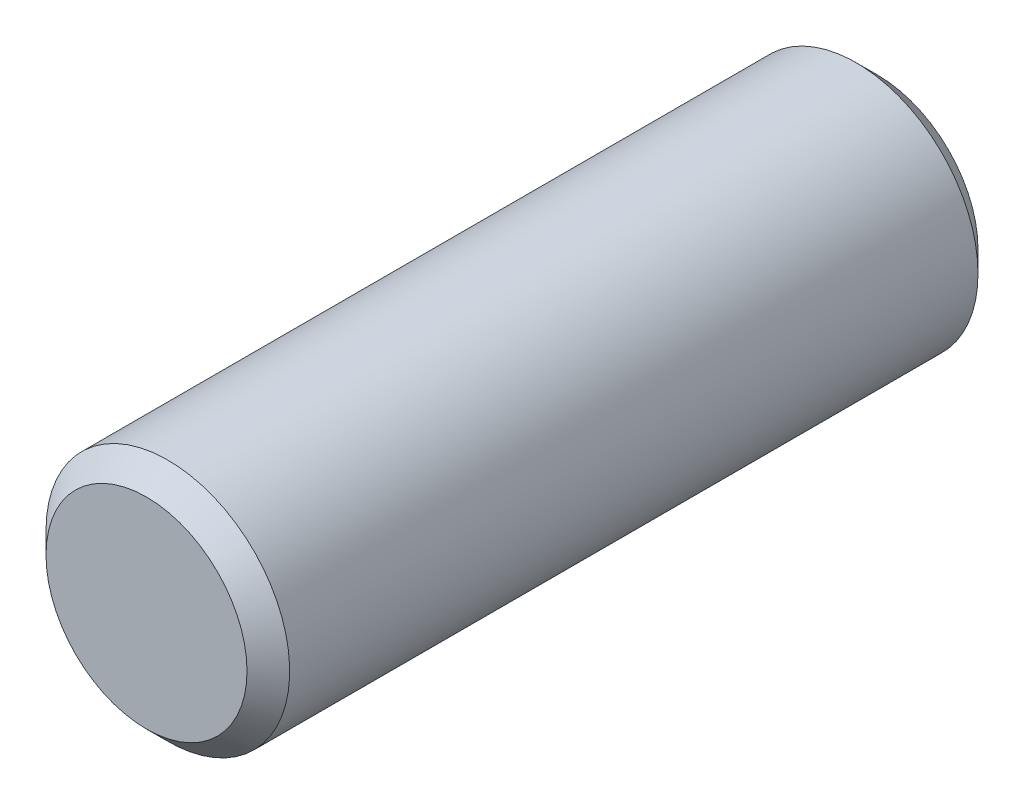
from build123d import *

# Parameters (mm, degrees)
SKETCH_1_R      = 2
EXTRUDE_1_DEPTH = 12
CHAMFER_1_SIZE  = 0.35


with BuildPart() as part:
    # Sketch 1 → Extrude 1 (new body)
    with BuildSketch(Plane.XY):
        Circle(SKETCH_1_R)
    extrude(amount=EXTRUDE_1_DEPTH)

    # Chamfer 1
    chamfer_1_edges = [part.edges().sort_by_distance(p)[0] for p in [
        (-2, 0, 0),
        (-2, 0, 12),
    ]]
    chamfer(chamfer_1_edges, length=CHAMFER_1_SIZE)


solid = part.part
